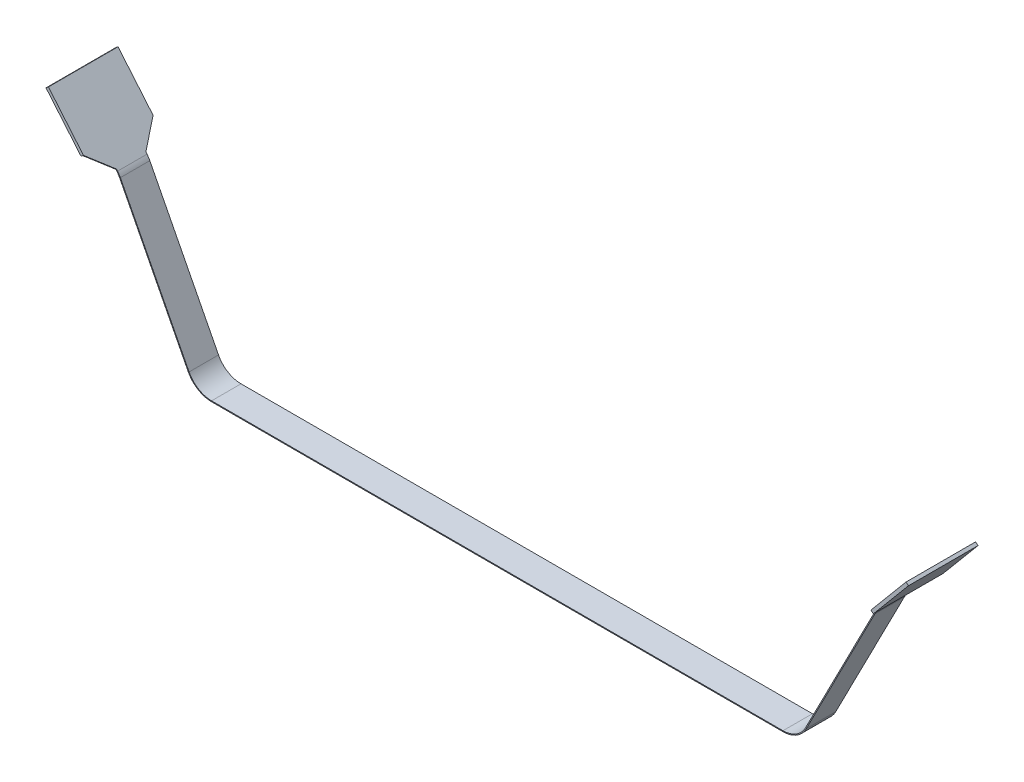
from build123d import *

# Parameters (mm, degrees)
EXTRUDE_THIN1_DEPTH = 6.75
EXTRUDE1_DEPTH      = 0.45
SKETCH3_W           = 31.908
SKETCH3_H           = 25
EXTRUDE2_DEPTH      = 1


with BuildPart() as part:
    # Sketch1 → Extrude-Thin1 (new, symmetric)
    with BuildSketch(Plane(origin=(0, -99.71053214, 0), x_dir=(1, 0, 0), z_dir=(0, 0, -1))):
        with BuildLine():
            Line((196.912443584, -96.590543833), (174.414877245, -69.778988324))
            ThreePointArc((174.414877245, -69.778988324), (173.744295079, -68.882296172), (173.178162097, -67.916257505))
            Line((173.178162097, -67.916257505), (141.676591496, -6.521825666))
            ThreePointArc((141.676591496, -6.521825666), (137.255473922, -1.759441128), (131, 0))
            Line((131, 0), (-131, 0))
            ThreePointArc((-131, 0), (-137.255473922, -1.759441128), (-141.676591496, -6.521825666))
            Line((-141.676591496, -6.521825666), (-173.178162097, -67.916257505))
            ThreePointArc((-173.178162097, -67.916257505), (-173.744295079, -68.882296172), (-174.414877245, -69.778988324))
            Line((-174.414877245, -69.778988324), (-196.912443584, -96.590543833))
            Line((-196.912443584, -96.590543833), (-196.606025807, -96.847658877))
            Line((-196.606025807, -96.847658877), (-174.108459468, -70.036103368))
            ThreePointArc((-174.108459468, -70.036103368), (-173.411054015, -69.103543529), (-172.822275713, -68.098863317))
            Line((-172.822275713, -68.098863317), (-141.320705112, -6.704431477))
            ThreePointArc((-141.320705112, -6.704431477), (-137.046958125, -2.100793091), (-131, -0.4))
            Line((-131, -0.4), (131, -0.4))
            ThreePointArc((131, -0.4), (137.046958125, -2.100793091), (141.320705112, -6.704431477))
            Line((141.320705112, -6.704431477), (172.822275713, -68.098863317))
            ThreePointArc((172.822275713, -68.098863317), (173.411054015, -69.103543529), (174.108459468, -70.036103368))
            Line((174.108459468, -70.036103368), (196.606025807, -96.847658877))
            Line((196.606025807, -96.847658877), (196.912443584, -96.590543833))
        make_face()
    extrude(amount=EXTRUDE_THIN1_DEPTH, both=True)

    # Sketch2 → Extrude1 (add)
    with BuildSketch(Plane(origin=(-116.782841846, -97.992439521, 0), x_dir=(0, 0, 1), z_dir=(-0.7660444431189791, -0.6427876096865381, 0))):
        Polygon((15.954, 124.182829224), (-15.954, 124.182829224), (-15.954, 99.182829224), (-6.75, 89.978829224), (6.75, 89.978829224), (15.954, 99.182829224), align=None)
    extrude1 = extrude(amount=EXTRUDE1_DEPTH)

    # Sketch3 → Extrude2 (add)
    with BuildSketch(Plane(origin=(-117.127561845, -98.281693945, 0), x_dir=(0, 0, 1), z_dir=(-0.7660444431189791, -0.6427876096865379, 0))):
        with Locations((0, 111.682829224)):
            Rectangle(SKETCH3_W, SKETCH3_H)
    extrude2 = extrude(amount=EXTRUDE2_DEPTH)

    # Mirror1: Extrude1, Extrude2 across plane
    add(extrude1.mirror(Plane(origin=(0, 0, 0), x_dir=(0, 0, 1), z_dir=(1, 0, 0))))
    add(extrude2.mirror(Plane(origin=(0, 0, 0), x_dir=(0, 0, 1), z_dir=(1, 0, 0))))


solid = part.part
